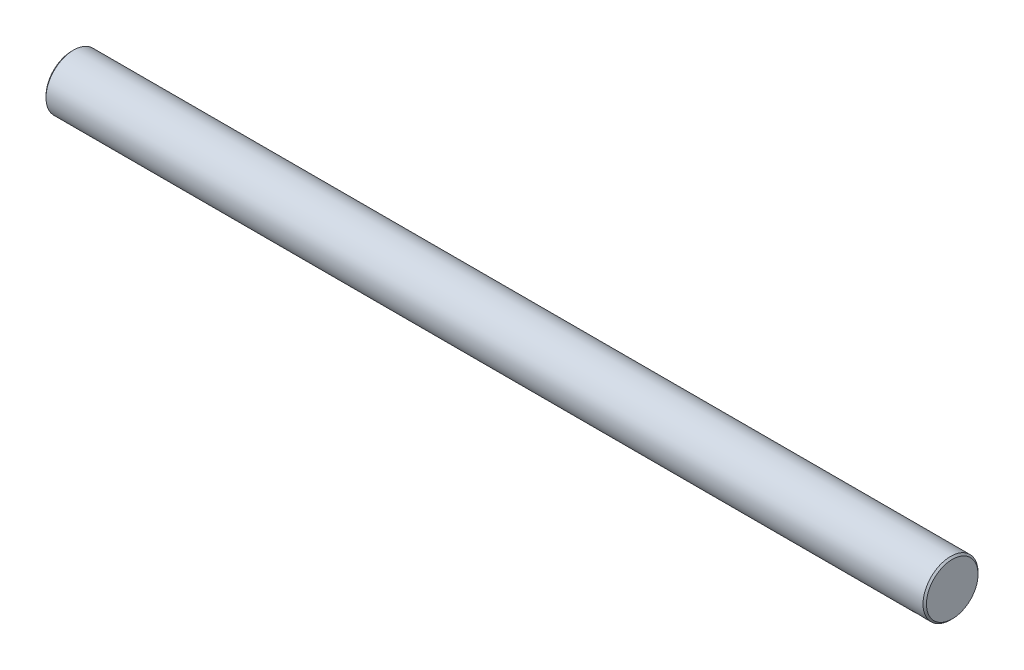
ISO-10303-21;
HEADER;
FILE_DESCRIPTION(('STEP AP214'),'2;1');
FILE_NAME('part.step','',(''),(''),'','','');
FILE_SCHEMA(('AUTOMOTIVE_DESIGN { 1 0 10303 214 1 1 1 1 }'));
ENDSEC;
DATA;
#1=APPLICATION_CONTEXT('core data for automotive mechanical design processes');
#2=APPLICATION_PROTOCOL_DEFINITION('international standard','automotive_design',2000,#1);
#3=PRODUCT_CONTEXT('',#1,'mechanical');
#4=PRODUCT('Part','Part','',(#3));
#5=PRODUCT_RELATED_PRODUCT_CATEGORY('part','',(#4));
#6=PRODUCT_DEFINITION_FORMATION('','',#4);
#7=PRODUCT_DEFINITION_CONTEXT('part definition',#1,'design');
#8=PRODUCT_DEFINITION('design','',#6,#7);
#9=PRODUCT_DEFINITION_SHAPE('','',#8);
#10=(LENGTH_UNIT() NAMED_UNIT(*) SI_UNIT(.MILLI.,.METRE.));
#11=(NAMED_UNIT(*) PLANE_ANGLE_UNIT() SI_UNIT($,.RADIAN.));
#12=(NAMED_UNIT(*) SI_UNIT($,.STERADIAN.) SOLID_ANGLE_UNIT());
#13=UNCERTAINTY_MEASURE_WITH_UNIT(LENGTH_MEASURE(1.E-05),#10,'distance_accuracy_value','');
#14=(GEOMETRIC_REPRESENTATION_CONTEXT(3) GLOBAL_UNCERTAINTY_ASSIGNED_CONTEXT((#13)) GLOBAL_UNIT_ASSIGNED_CONTEXT((#10,
#11,#12)) REPRESENTATION_CONTEXT('',''));
#15=CARTESIAN_POINT('',(0.,0.,0.));
#16=DIRECTION('',(0.,0.,1.));
#17=DIRECTION('',(1.,0.,0.));
#18=AXIS2_PLACEMENT_3D('',#15,#16,#17);
#19=CARTESIAN_POINT('',(128.,8.00000000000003,0.));
#20=DIRECTION('',(-1.,0.,0.));
#21=DIRECTION('',(0.,0.,1.));
#22=AXIS2_PLACEMENT_3D('',#19,#20,#21);
#23=PLANE('',#22);
#24=CARTESIAN_POINT('',(128.,0.,0.));
#25=DIRECTION('',(-1.,0.,0.));
#26=DIRECTION('',(0.,0.,1.));
#27=AXIS2_PLACEMENT_3D('',#24,#25,#26);
#28=CIRCLE('',#27,7.50000000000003);
#29=CARTESIAN_POINT('',(128.,0.,7.50000000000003));
#30=VERTEX_POINT('',#29);
#31=EDGE_CURVE('E19',#30,#30,#28,.T.);
#32=ORIENTED_EDGE('',*,*,#31,.F.);
#33=EDGE_LOOP('',(#32));
#34=FACE_BOUND('',#33,.T.);
#35=ADVANCED_FACE('F16',(#34),#23,.F.);
#36=CARTESIAN_POINT('',(-128.,8.,0.));
#37=DIRECTION('',(1.,0.,0.));
#38=DIRECTION('',(0.,0.,-1.));
#39=AXIS2_PLACEMENT_3D('',#36,#37,#38);
#40=PLANE('',#39);
#41=CARTESIAN_POINT('',(-128.,0.,0.));
#42=DIRECTION('',(1.,0.,0.));
#43=DIRECTION('',(0.,0.,-1.));
#44=AXIS2_PLACEMENT_3D('',#41,#42,#43);
#45=CIRCLE('',#44,7.50000000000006);
#46=CARTESIAN_POINT('',(-128.,0.,-7.50000000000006));
#47=VERTEX_POINT('',#46);
#48=EDGE_CURVE('E57',#47,#47,#45,.T.);
#49=ORIENTED_EDGE('',*,*,#48,.F.);
#50=EDGE_LOOP('',(#49));
#51=FACE_BOUND('',#50,.T.);
#52=ADVANCED_FACE('F73',(#51),#40,.F.);
#53=CARTESIAN_POINT('',(122.5,-5.,-10.));
#54=DIRECTION('',(-1.,0.,0.));
#55=DIRECTION('',(0.,0.,1.));
#56=AXIS2_PLACEMENT_3D('',#53,#54,#55);
#57=PLANE('',#56);
#58=CARTESIAN_POINT('',(122.5,0.,0.));
#59=DIRECTION('',(-1.,0.,0.));
#60=DIRECTION('',(0.,0.,1.));
#61=AXIS2_PLACEMENT_3D('',#58,#59,#60);
#62=CIRCLE('',#61,8.00000000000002);
#63=CARTESIAN_POINT('',(122.5,-5.,-6.24499799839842));
#64=VERTEX_POINT('',#63);
#65=CARTESIAN_POINT('',(122.5,-5.,6.24499799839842));
#66=VERTEX_POINT('',#65);
#67=EDGE_CURVE('E50',#64,#66,#62,.T.);
#68=ORIENTED_EDGE('',*,*,#67,.F.);
#69=DIRECTION('',(0.,0.,1.));
#70=VECTOR('',#69,1.);
#71=CARTESIAN_POINT('',(122.5,-5.,-10.));
#72=LINE('',#71,#70);
#73=EDGE_CURVE('E40',#64,#66,#72,.T.);
#74=ORIENTED_EDGE('',*,*,#73,.T.);
#75=EDGE_LOOP('',(#68,#74));
#76=FACE_BOUND('',#75,.T.);
#77=ADVANCED_FACE('F51',(#76),#57,.F.);
#78=CARTESIAN_POINT('',(122.5,-5.,-10.));
#79=DIRECTION('',(0.,1.,0.));
#80=DIRECTION('',(0.,0.,1.));
#81=AXIS2_PLACEMENT_3D('',#78,#79,#80);
#82=PLANE('',#81);
#83=DIRECTION('',(-1.,0.,0.));
#84=VECTOR('',#83,1.);
#85=CARTESIAN_POINT('',(-140.464918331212,-5.,6.24499799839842));
#86=LINE('',#85,#84);
#87=CARTESIAN_POINT('',(125.,-5.,6.24499799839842));
#88=VERTEX_POINT('',#87);
#89=EDGE_CURVE('E46',#66,#88,#86,.F.);
#90=ORIENTED_EDGE('',*,*,#89,.F.);
#91=ORIENTED_EDGE('',*,*,#73,.F.);
#92=DIRECTION('',(-1.,0.,0.));
#93=VECTOR('',#92,1.);
#94=CARTESIAN_POINT('',(-140.464918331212,-5.,-6.24499799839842));
#95=LINE('',#94,#93);
#96=CARTESIAN_POINT('',(125.,-5.,-6.24499799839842));
#97=VERTEX_POINT('',#96);
#98=EDGE_CURVE('E44',#97,#64,#95,.T.);
#99=ORIENTED_EDGE('',*,*,#98,.F.);
#100=DIRECTION('',(0.,0.,-1.));
#101=VECTOR('',#100,1.);
#102=CARTESIAN_POINT('',(125.,-5.,-10.));
#103=LINE('',#102,#101);
#104=EDGE_CURVE('E33',#97,#88,#103,.F.);
#105=ORIENTED_EDGE('',*,*,#104,.T.);
#106=EDGE_LOOP('',(#90,#91,#99,#105));
#107=FACE_BOUND('',#106,.T.);
#108=ADVANCED_FACE('F42',(#107),#82,.F.);
#109=CARTESIAN_POINT('',(125.,-5.,-10.));
#110=DIRECTION('',(1.,0.,0.));
#111=DIRECTION('',(0.,0.,-1.));
#112=AXIS2_PLACEMENT_3D('',#109,#110,#111);
#113=PLANE('',#112);
#114=CARTESIAN_POINT('',(125.,0.,0.));
#115=DIRECTION('',(-1.,0.,0.));
#116=DIRECTION('',(0.,0.,1.));
#117=AXIS2_PLACEMENT_3D('',#114,#115,#116);
#118=CIRCLE('',#117,8.00000000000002);
#119=EDGE_CURVE('E56',#88,#97,#118,.F.);
#120=ORIENTED_EDGE('',*,*,#119,.F.);
#121=ORIENTED_EDGE('',*,*,#104,.F.);
#122=EDGE_LOOP('',(#120,#121));
#123=FACE_BOUND('',#122,.T.);
#124=ADVANCED_FACE('F92',(#123),#113,.F.);
#125=CARTESIAN_POINT('',(127.5,0.,0.));
#126=DIRECTION('',(-1.,0.,0.));
#127=DIRECTION('',(0.,0.,1.));
#128=AXIS2_PLACEMENT_3D('',#125,#126,#127);
#129=CONICAL_SURFACE('',#128,8.00000000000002,0.78539816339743);
#130=CARTESIAN_POINT('',(127.5,0.,0.));
#131=DIRECTION('',(-1.,0.,0.));
#132=DIRECTION('',(0.,0.,1.));
#133=AXIS2_PLACEMENT_3D('',#130,#131,#132);
#134=CIRCLE('',#133,8.00000000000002);
#135=CARTESIAN_POINT('',(127.5,0.,8.00000000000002));
#136=VERTEX_POINT('',#135);
#137=EDGE_CURVE('E25',#136,#136,#134,.T.);
#138=ORIENTED_EDGE('',*,*,#137,.F.);
#139=EDGE_LOOP('',(#138));
#140=FACE_BOUND('',#139,.T.);
#141=ORIENTED_EDGE('',*,*,#31,.T.);
#142=EDGE_LOOP('',(#141));
#143=FACE_BOUND('',#142,.T.);
#144=ADVANCED_FACE('F70',(#140,#143),#129,.T.);
#145=CARTESIAN_POINT('',(-127.5,0.,0.));
#146=DIRECTION('',(1.,0.,0.));
#147=DIRECTION('',(0.,0.,-1.));
#148=AXIS2_PLACEMENT_3D('',#145,#146,#147);
#149=CONICAL_SURFACE('',#148,8.00000000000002,0.785398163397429);
#150=CARTESIAN_POINT('',(-127.5,0.,0.));
#151=DIRECTION('',(-1.,0.,0.));
#152=DIRECTION('',(0.,0.,1.));
#153=AXIS2_PLACEMENT_3D('',#150,#151,#152);
#154=CIRCLE('',#153,8.00000000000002);
#155=CARTESIAN_POINT('',(-127.5,0.,8.00000000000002));
#156=VERTEX_POINT('',#155);
#157=EDGE_CURVE('E11',#156,#156,#154,.F.);
#158=ORIENTED_EDGE('',*,*,#157,.F.);
#159=EDGE_LOOP('',(#158));
#160=FACE_BOUND('',#159,.T.);
#161=ORIENTED_EDGE('',*,*,#48,.T.);
#162=EDGE_LOOP('',(#161));
#163=FACE_BOUND('',#162,.T.);
#164=ADVANCED_FACE('F80',(#160,#163),#149,.T.);
#165=CARTESIAN_POINT('',(-140.464918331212,0.,0.));
#166=DIRECTION('',(-1.,0.,0.));
#167=DIRECTION('',(0.,0.,1.));
#168=AXIS2_PLACEMENT_3D('',#165,#166,#167);
#169=CYLINDRICAL_SURFACE('',#168,8.00000000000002);
#170=ORIENTED_EDGE('',*,*,#157,.T.);
#171=EDGE_LOOP('',(#170));
#172=FACE_BOUND('',#171,.T.);
#173=ORIENTED_EDGE('',*,*,#137,.T.);
#174=EDGE_LOOP('',(#173));
#175=FACE_BOUND('',#174,.T.);
#176=ORIENTED_EDGE('',*,*,#89,.T.);
#177=ORIENTED_EDGE('',*,*,#119,.T.);
#178=ORIENTED_EDGE('',*,*,#98,.T.);
#179=ORIENTED_EDGE('',*,*,#67,.T.);
#180=EDGE_LOOP('',(#176,#177,#178,#179));
#181=FACE_BOUND('',#180,.T.);
#182=ADVANCED_FACE('F55',(#172,#175,#181),#169,.T.);
#183=CLOSED_SHELL('',(#35,#52,#77,#108,#124,#144,#164,#182));
#184=MANIFOLD_SOLID_BREP('B1',#183);
#185=ADVANCED_BREP_SHAPE_REPRESENTATION('',(#18,#184),#14);
#186=SHAPE_DEFINITION_REPRESENTATION(#9,#185);
ENDSEC;
END-ISO-10303-21;
